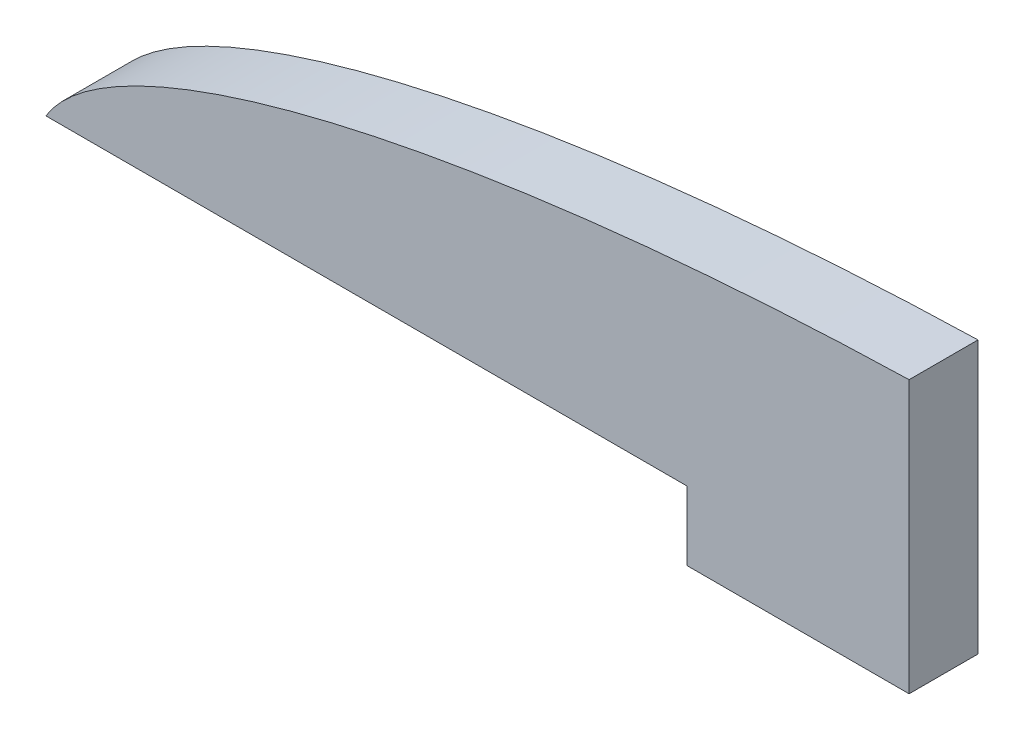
from build123d import *

# Parameters (mm, degrees)
BOSS_EXTRUDE1_DEPTH = 3.175


with BuildPart() as part:
    # Sketch1 → Boss-Extrude1 (new body)
    with BuildSketch(Plane.XY):
        with BuildLine():
            Line((-4.7625, 0), (-4.7625, 10.947084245))
            add(Edge.make_bspline(
                [(-4.7625, 10.947084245), (-39.493179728, 10.042782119), (-44.529676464, 1.5875)],
                knots=[4.818420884, 4.818420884, 4.818420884, 6.13847946, 6.13847946, 6.13847946], degree=2, weights=[1, 0.789974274, 1]))
            Line((-44.529676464, 1.5875), (-15, 1.5875))
            Line((-15, 1.5875), (-15, -1.5875))
            Line((-15, -1.5875), (-4.7625, -1.5875))
            Line((-4.7625, -1.5875), (-4.7625, 0))
        make_face()
    extrude(amount=BOSS_EXTRUDE1_DEPTH)


solid = part.part
